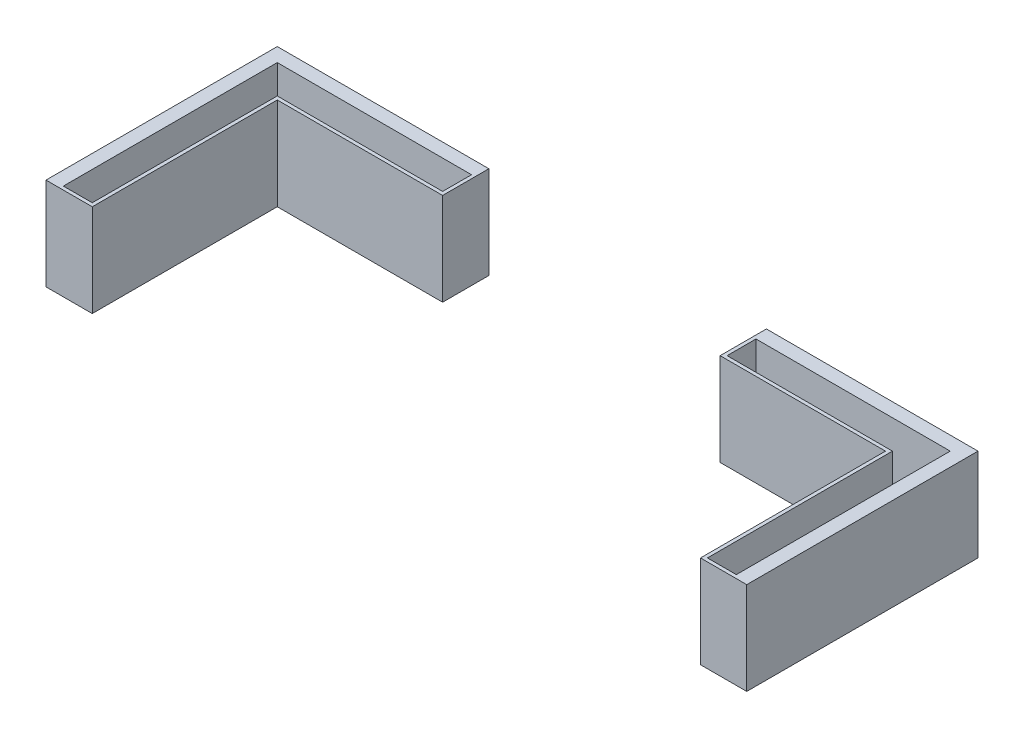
from build123d import *

# Parameters (mm, degrees)
CROQUIS1_W                = 915
CROQUIS1_H                = 400
SALIENTE_EXTRUIR1_DEPTH   = 60
SALIENTE_EXTRUIR1_2_DEPTH = 60
CROQUIS2_W                = 60
CROQUIS2_H                = 400
SALIENTE_EXTRUIR2_DEPTH   = 940
SALIENTE_EXTRUIR4_DEPTH   = 400


with BuildPart() as part:
    # Croquis1 → Saliente-Extruir1 (new body)
    with BuildSketch(Plane.XY):
        with Locations((1064.948374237, -291.370616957)):
            Rectangle(CROQUIS1_W, CROQUIS1_H)
    extrude(amount=SALIENTE_EXTRUIR1_DEPTH)



with BuildPart() as body_2:
    # Croquis1 → Saliente-Extruir1 2 (new body)
    with BuildSketch(Plane.XY):
        with Locations((-1050.051625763, -291.370616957)):
            Rectangle(CROQUIS1_W, CROQUIS1_H)
    extrude(amount=SALIENTE_EXTRUIR1_2_DEPTH)


with BuildPart() as part_1:
    add(part.part)

    add(body_2.part)  # Saliente-Extruir2 merges body 2
    # Croquis2 → Saliente-Extruir2 (add)
    with BuildSketch(Plane.XY.offset(60)):
        with Locations((1492.448374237, -291.370616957)):
            Rectangle(CROQUIS2_W, CROQUIS2_H)
        with Locations((-1477.551625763, -291.370616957)):
            Rectangle(CROQUIS2_W, CROQUIS2_H)
    extrude(amount=SALIENTE_EXTRUIR2_DEPTH)

    # Croquis4 → Saliente-Extruir4 (add)
    with BuildSketch(Plane(origin=(0, -91.370616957, 0), x_dir=(1, 0, 0), z_dir=(0, 1, 0))):
        Polygon((622.448374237, -185), (622.448374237, -60), (607.448374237, -60), (607.448374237, -200), (1322.448374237, -200), (1322.448374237, -1000), (1462.448374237, -1000), (1462.448374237, -985), (1337.448374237, -985), (1337.448374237, -185), align=None)
        Polygon((-1507.551625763, -985), (-1507.551625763, -1000), (-1307.551625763, -1000), (-1307.551625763, -200), (-592.551625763, -200), (-592.551625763, 0), (-607.551625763, 0), (-607.551625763, -185), (-1322.551625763, -185), (-1322.551625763, -985), align=None)
    extrude(amount=-SALIENTE_EXTRUIR4_DEPTH)


solid = part_1.part
